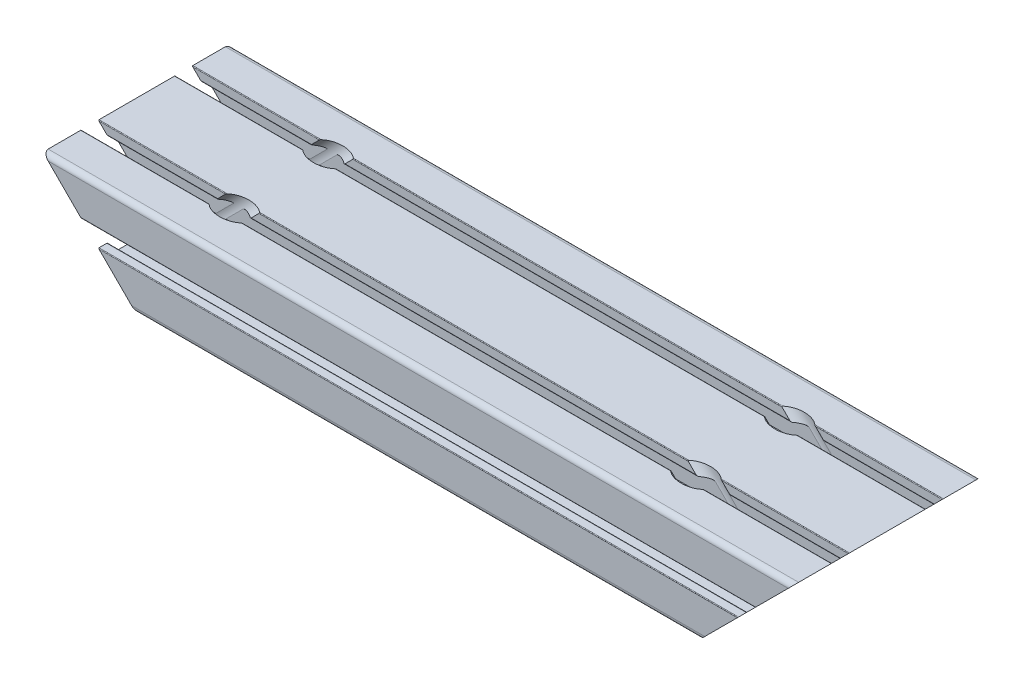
from build123d import *

# Parameters (mm, degrees)
MODEL_R                                 = 5.85
F_45_SARJA_1_0036_45X90_1_DEPTH         = 360
CUT_EXTRUDE1_DEPTH                      = 216.942700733
CBORE_FOR_M8_HEX_HEAD_BOLT1_D           = 8.5
CBORE_FOR_M8_HEX_HEAD_BOLT1_CBORE_D     = 14
CBORE_FOR_M8_HEX_HEAD_BOLT1_CBORE_DEPTH = 40


with BuildPart() as part:
    # Model → 45-sarja 1.0036 45X90_1 (new body)
    with BuildSketch(Plane(origin=(195, 0, 0), x_dir=(0, 1, 0), z_dir=(-1, 0, 0))):
        with BuildLine():
            Line((4.4, -45), (20, -45))
            ThreePointArc((20, -45), (21.767766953, -44.267766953), (22.5, -42.5))
            Line((22.5, -42.5), (22.5, -26.9))
            ThreePointArc((22.5, -26.9), (22.412132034, -26.687867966), (22.2, -26.6))
            Line((22.2, -26.6), (18.5, -26.6))
            ThreePointArc((18.5, -26.6), (18.146446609, -26.746446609), (18, -27.1))
            Line((18, -27.1), (18, -29))
            ThreePointArc((18, -29), (17.912132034, -29.212132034), (17.7, -29.3))
            Line((17.7, -29.3), (9.2, -29.3))
            Line((9.2, -29.3), (7.2, -27.3))
            Line((7.2, -27.3), (7.2, -17.7))
            Line((7.2, -17.7), (9.2, -15.7))
            Line((9.2, -15.7), (17.7, -15.7))
            ThreePointArc((17.7, -15.7), (17.912132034, -15.787867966), (18, -16))
            Line((18, -16), (18, -17.9))
            ThreePointArc((18, -17.9), (18.146446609, -18.253553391), (18.5, -18.4))
            Line((18.5, -18.4), (22.2, -18.4))
            ThreePointArc((22.2, -18.4), (22.412132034, -18.312132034), (22.5, -18.1))
            Line((22.5, -18.1), (22.5, 18.1))
            ThreePointArc((22.5, 18.1), (22.412132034, 18.312132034), (22.2, 18.4))
            Line((22.2, 18.4), (18.5, 18.4))
            ThreePointArc((18.5, 18.4), (18.146446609, 18.253553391), (18, 17.9))
            Line((18, 17.9), (18, 16.000000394))
            ThreePointArc((18, 16.000000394), (17.912132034, 15.78786836), (17.7, 15.700000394))
            Line((17.7, 15.700000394), (9.2, 15.700000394))
            Line((9.2, 15.700000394), (7.2, 17.7))
            Line((7.2, 17.7), (7.2, 27.3))
            Line((7.2, 27.3), (9.2, 29.299999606))
            Line((9.2, 29.299999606), (17.7, 29.299999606))
            ThreePointArc((17.7, 29.299999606), (17.912132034, 29.21213164), (18, 28.999999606))
            Line((18, 28.999999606), (18, 27.1))
            ThreePointArc((18, 27.1), (18.146446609, 26.746446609), (18.5, 26.6))
            Line((18.5, 26.6), (22.2, 26.6))
            ThreePointArc((22.2, 26.6), (22.412132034, 26.687867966), (22.5, 26.9))
            Line((22.5, 26.9), (22.5, 42.5))
            ThreePointArc((22.5, 42.5), (21.767766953, 44.267766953), (20, 45))
            Line((20, 45), (4.4, 45))
            ThreePointArc((4.4, 45), (4.187867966, 44.912132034), (4.1, 44.7))
            Line((4.1, 44.7), (4.1, 41))
            ThreePointArc((4.1, 41), (4.246446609, 40.646446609), (4.6, 40.5))
            Line((4.6, 40.5), (6.5, 40.5))
            ThreePointArc((6.5, 40.5), (6.712132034, 40.412132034), (6.8, 40.2))
            Line((6.8, 40.2), (6.8, 31.7))
            Line((6.8, 31.7), (4.8, 29.7))
            Line((4.8, 29.7), (-4.8, 29.7))
            Line((-4.8, 29.7), (-6.8, 31.7))
            Line((-6.8, 31.7), (-6.8, 40.2))
            ThreePointArc((-6.8, 40.2), (-6.712132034, 40.412132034), (-6.5, 40.5))
            Line((-6.5, 40.5), (-4.6, 40.5))
            ThreePointArc((-4.6, 40.5), (-4.246446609, 40.646446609), (-4.1, 41))
            Line((-4.1, 41), (-4.1, 44.7))
            ThreePointArc((-4.1, 44.7), (-4.187867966, 44.912132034), (-4.4, 45))
            Line((-4.4, 45), (-20, 45))
            ThreePointArc((-20, 45), (-21.767766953, 44.267766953), (-22.5, 42.5))
            Line((-22.5, 42.5), (-22.5, 26.9))
            ThreePointArc((-22.5, 26.9), (-22.412132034, 26.687867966), (-22.2, 26.6))
            Line((-22.2, 26.6), (-18.5, 26.6))
            ThreePointArc((-18.5, 26.6), (-18.146446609, 26.746446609), (-18, 27.1))
            Line((-18, 27.1), (-18, 28.999999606))
            ThreePointArc((-18, 28.999999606), (-17.912132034, 29.21213164), (-17.7, 29.299999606))
            Line((-17.7, 29.299999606), (-9.199999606, 29.299999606))
            Line((-9.199999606, 29.299999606), (-7.2, 27.3))
            Line((-7.2, 27.3), (-7.2, 17.7))
            Line((-7.2, 17.7), (-9.199999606, 15.700000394))
            Line((-9.199999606, 15.700000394), (-17.7, 15.700000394))
            ThreePointArc((-17.7, 15.700000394), (-17.912132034, 15.78786836), (-18, 16.000000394))
            Line((-18, 16.000000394), (-18, 17.9))
            ThreePointArc((-18, 17.9), (-18.146446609, 18.253553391), (-18.5, 18.4))
            Line((-18.5, 18.4), (-22.2, 18.4))
            ThreePointArc((-22.2, 18.4), (-22.412132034, 18.312132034), (-22.5, 18.1))
            Line((-22.5, 18.1), (-22.5, -18.1))
            ThreePointArc((-22.5, -18.1), (-22.412132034, -18.312132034), (-22.2, -18.4))
            Line((-22.2, -18.4), (-18.5, -18.4))
            ThreePointArc((-18.5, -18.4), (-18.146446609, -18.253553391), (-18, -17.9))
            Line((-18, -17.9), (-18, -16))
            ThreePointArc((-18, -16), (-17.912132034, -15.787867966), (-17.7, -15.7))
            Line((-17.7, -15.7), (-9.2, -15.7))
            Line((-9.2, -15.7), (-7.2, -17.7))
            Line((-7.2, -17.7), (-7.2, -27.3))
            Line((-7.2, -27.3), (-9.2, -29.3))
            Line((-9.2, -29.3), (-17.7, -29.3))
            ThreePointArc((-17.7, -29.3), (-17.912132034, -29.212132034), (-18, -29))
            Line((-18, -29), (-18, -27.1))
            ThreePointArc((-18, -27.1), (-18.146446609, -26.746446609), (-18.5, -26.6))
            Line((-18.5, -26.6), (-22.2, -26.6))
            ThreePointArc((-22.2, -26.6), (-22.412132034, -26.687867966), (-22.5, -26.9))
            Line((-22.5, -26.9), (-22.5, -42.5))
            ThreePointArc((-22.5, -42.5), (-21.767766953, -44.267766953), (-20, -45))
            Line((-20, -45), (-4.4, -45))
            ThreePointArc((-4.4, -45), (-4.187867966, -44.912132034), (-4.1, -44.7))
            Line((-4.1, -44.7), (-4.1, -41))
            ThreePointArc((-4.1, -41), (-4.246446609, -40.646446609), (-4.6, -40.5))
            Line((-4.6, -40.5), (-6.5, -40.5))
            ThreePointArc((-6.5, -40.5), (-6.712132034, -40.412132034), (-6.8, -40.2))
            Line((-6.8, -40.2), (-6.8, -31.7))
            Line((-6.8, -31.7), (-4.8, -29.7))
            Line((-4.8, -29.7), (4.8, -29.7))
            Line((4.8, -29.7), (6.8, -31.7))
            Line((6.8, -31.7), (6.8, -40.2))
            ThreePointArc((6.8, -40.2), (6.712132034, -40.412132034), (6.5, -40.5))
            Line((6.5, -40.5), (4.6, -40.5))
            ThreePointArc((4.6, -40.5), (4.246446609, -40.646446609), (4.1, -41))
            Line((4.1, -41), (4.1, -44.7))
            ThreePointArc((4.1, -44.7), (4.187867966, -44.912132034), (4.4, -45))
        make_face()
        with Locations((14.65, 37.15)):
            Circle(MODEL_R, mode=Mode.SUBTRACT)
        with Locations((14.65, -37.15)):
            Circle(MODEL_R, mode=Mode.SUBTRACT)
        with Locations((-14.65, -37.15)):
            Circle(MODEL_R, mode=Mode.SUBTRACT)
        with Locations((-14.65, 37.15)):
            Circle(MODEL_R, mode=Mode.SUBTRACT)
        with BuildLine():
            Line((4.384062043, 25.89411255), (3.39411255, 26.884062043))
            ThreePointArc((3.39411255, 26.884062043), (3.181980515, 26.971930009), (2.969848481, 26.884062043))
            Line((2.969848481, 26.884062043), (1.949077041, 25.863290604))
            ThreePointArc((1.949077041, 25.863290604), (1.786690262, 25.779575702), (1.605854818, 25.80557942))
            ThreePointArc((1.605854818, 25.80557942), (0, 26.175), (-1.605854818, 25.80557942))
            ThreePointArc((-1.605854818, 25.80557942), (-1.786690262, 25.779575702), (-1.949077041, 25.863290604))
            Line((-1.949077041, 25.863290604), (-2.969848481, 26.884062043))
            ThreePointArc((-2.969848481, 26.884062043), (-3.181980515, 26.971930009), (-3.39411255, 26.884062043))
            Line((-3.39411255, 26.884062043), (-4.384062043, 25.89411255))
            ThreePointArc((-4.384062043, 25.89411255), (-4.471930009, 25.681980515), (-4.384062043, 25.469848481))
            Line((-4.384062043, 25.469848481), (-3.363290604, 24.449077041))
            ThreePointArc((-3.363290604, 24.449077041), (-3.279575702, 24.286690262), (-3.30557942, 24.105854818))
            ThreePointArc((-3.30557942, 24.105854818), (-3.675, 22.5), (-3.30557942, 20.894145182))
            ThreePointArc((-3.30557942, 20.894145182), (-3.279575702, 20.713309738), (-3.363290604, 20.550922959))
            Line((-3.363290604, 20.550922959), (-4.384062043, 19.530151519))
            ThreePointArc((-4.384062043, 19.530151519), (-4.471930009, 19.318019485), (-4.384062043, 19.10588745))
            Line((-4.384062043, 19.10588745), (-3.39411255, 18.115937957))
            ThreePointArc((-3.39411255, 18.115937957), (-3.181980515, 18.028069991), (-2.969848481, 18.115937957))
            Line((-2.969848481, 18.115937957), (-1.949077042, 19.136709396))
            ThreePointArc((-1.949077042, 19.136709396), (-1.786690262, 19.220424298), (-1.605854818, 19.19442058))
            ThreePointArc((-1.605854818, 19.19442058), (0, 18.825), (1.605854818, 19.19442058))
            ThreePointArc((1.605854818, 19.19442058), (1.786690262, 19.220424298), (1.949077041, 19.136709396))
            Line((1.949077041, 19.136709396), (2.969848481, 18.115937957))
            ThreePointArc((2.969848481, 18.115937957), (3.181980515, 18.028069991), (3.39411255, 18.115937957))
            Line((3.39411255, 18.115937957), (4.384062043, 19.10588745))
            ThreePointArc((4.384062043, 19.10588745), (4.471930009, 19.318019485), (4.384062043, 19.530151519))
            Line((4.384062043, 19.530151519), (3.363290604, 20.550922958))
            ThreePointArc((3.363290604, 20.550922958), (3.279575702, 20.713309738), (3.30557942, 20.894145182))
            ThreePointArc((3.30557942, 20.894145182), (3.675, 22.5), (3.30557942, 24.105854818))
            ThreePointArc((3.30557942, 24.105854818), (3.279575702, 24.286690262), (3.363290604, 24.449077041))
            Line((3.363290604, 24.449077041), (4.384062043, 25.469848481))
            ThreePointArc((4.384062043, 25.469848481), (4.471930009, 25.681980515), (4.384062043, 25.89411255))
        make_face(mode=Mode.SUBTRACT)
        with BuildLine():
            Line((-19.5, 12.5), (-19.5, -12.5))
            ThreePointArc((-19.5, -12.5), (-19.207106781, -13.207106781), (-18.5, -13.5))
            Line((-18.5, -13.5), (18.5, -13.5))
            ThreePointArc((18.5, -13.5), (19.207106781, -13.207106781), (19.5, -12.5))
            Line((19.5, -12.5), (19.5, 12.5))
            ThreePointArc((19.5, 12.5), (19.207106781, 13.207106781), (18.5, 13.5))
            Line((18.5, 13.5), (-18.5, 13.5))
            ThreePointArc((-18.5, 13.5), (-19.207106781, 13.207106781), (-19.5, 12.5))
        make_face(mode=Mode.SUBTRACT)
        with BuildLine():
            Line((3.363290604, -20.550922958), (4.384062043, -19.530151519))
            ThreePointArc((4.384062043, -19.530151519), (4.471930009, -19.318019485), (4.384062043, -19.10588745))
            Line((4.384062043, -19.10588745), (3.39411255, -18.115937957))
            ThreePointArc((3.39411255, -18.115937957), (3.181980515, -18.028069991), (2.969848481, -18.115937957))
            Line((2.969848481, -18.115937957), (1.949077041, -19.136709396))
            ThreePointArc((1.949077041, -19.136709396), (1.786690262, -19.220424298), (1.605854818, -19.19442058))
            ThreePointArc((1.605854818, -19.19442058), (0, -18.825), (-1.605854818, -19.19442058))
            ThreePointArc((-1.605854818, -19.19442058), (-1.786690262, -19.220424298), (-1.949077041, -19.136709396))
            Line((-1.949077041, -19.136709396), (-2.969848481, -18.115937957))
            ThreePointArc((-2.969848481, -18.115937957), (-3.181980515, -18.028069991), (-3.39411255, -18.115937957))
            Line((-3.39411255, -18.115937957), (-4.384062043, -19.10588745))
            ThreePointArc((-4.384062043, -19.10588745), (-4.471930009, -19.318019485), (-4.384062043, -19.530151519))
            Line((-4.384062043, -19.530151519), (-3.363290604, -20.550922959))
            ThreePointArc((-3.363290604, -20.550922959), (-3.279575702, -20.713309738), (-3.30557942, -20.894145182))
            ThreePointArc((-3.30557942, -20.894145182), (-3.675, -22.5), (-3.30557942, -24.105854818))
            ThreePointArc((-3.30557942, -24.105854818), (-3.279575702, -24.286690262), (-3.363290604, -24.449077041))
            Line((-3.363290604, -24.449077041), (-4.384062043, -25.469848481))
            ThreePointArc((-4.384062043, -25.469848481), (-4.471930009, -25.681980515), (-4.384062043, -25.89411255))
            Line((-4.384062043, -25.89411255), (-3.39411255, -26.884062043))
            ThreePointArc((-3.39411255, -26.884062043), (-3.181980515, -26.971930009), (-2.969848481, -26.884062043))
            Line((-2.969848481, -26.884062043), (-1.949077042, -25.863290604))
            ThreePointArc((-1.949077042, -25.863290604), (-1.786690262, -25.779575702), (-1.605854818, -25.80557942))
            ThreePointArc((-1.605854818, -25.80557942), (0, -26.175), (1.605854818, -25.80557942))
            ThreePointArc((1.605854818, -25.80557942), (1.786690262, -25.779575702), (1.949077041, -25.863290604))
            Line((1.949077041, -25.863290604), (2.969848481, -26.884062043))
            ThreePointArc((2.969848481, -26.884062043), (3.181980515, -26.971930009), (3.39411255, -26.884062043))
            Line((3.39411255, -26.884062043), (4.384062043, -25.89411255))
            ThreePointArc((4.384062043, -25.89411255), (4.471930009, -25.681980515), (4.384062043, -25.469848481))
            Line((4.384062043, -25.469848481), (3.363290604, -24.449077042))
            ThreePointArc((3.363290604, -24.449077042), (3.279575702, -24.286690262), (3.30557942, -24.105854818))
            ThreePointArc((3.30557942, -24.105854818), (3.675, -22.5), (3.30557942, -20.894145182))
            ThreePointArc((3.30557942, -20.894145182), (3.279575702, -20.713309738), (3.363290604, -20.550922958))
        make_face(mode=Mode.SUBTRACT)
    extrude(amount=F_45_SARJA_1_0036_45X90_1_DEPTH)

    # Sketch2 → Cut-Extrude1 (cut, through all)
    with BuildSketch(Plane.XY.offset(45)):
        Polygon((195, 22.5), (150, -22.5), (200.453955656, -30.75894942), align=None)
        Polygon((-165, 22.5), (-120, -22.5), (-205.8254478, -31.758328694), align=None)
    extrude(amount=-CUT_EXTRUDE1_DEPTH, mode=Mode.SUBTRACT)

    # CBORE for M8 Hex Head Bolt1 (through all)
    with Locations(Plane(origin=(45.944913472, -45.944913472, 0), x_dir=(0, 0, -1), z_dir=(-0.7071067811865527, 0.7071067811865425, 0))):
        with Locations((22.5, -104.795724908), (-22.5, -104.795724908)):
            cbore_for_m8_hex_head_bolt1 = CounterBoreHole(CBORE_FOR_M8_HEX_HEAD_BOLT1_D / 2, CBORE_FOR_M8_HEX_HEAD_BOLT1_CBORE_D / 2, CBORE_FOR_M8_HEX_HEAD_BOLT1_CBORE_DEPTH)

    # Mirror3: CBORE for M8 Hex Head Bolt1 across plane
    add(cbore_for_m8_hex_head_bolt1.mirror(Plane.ZY.offset(-15)), mode=Mode.SUBTRACT)


solid = part.part
